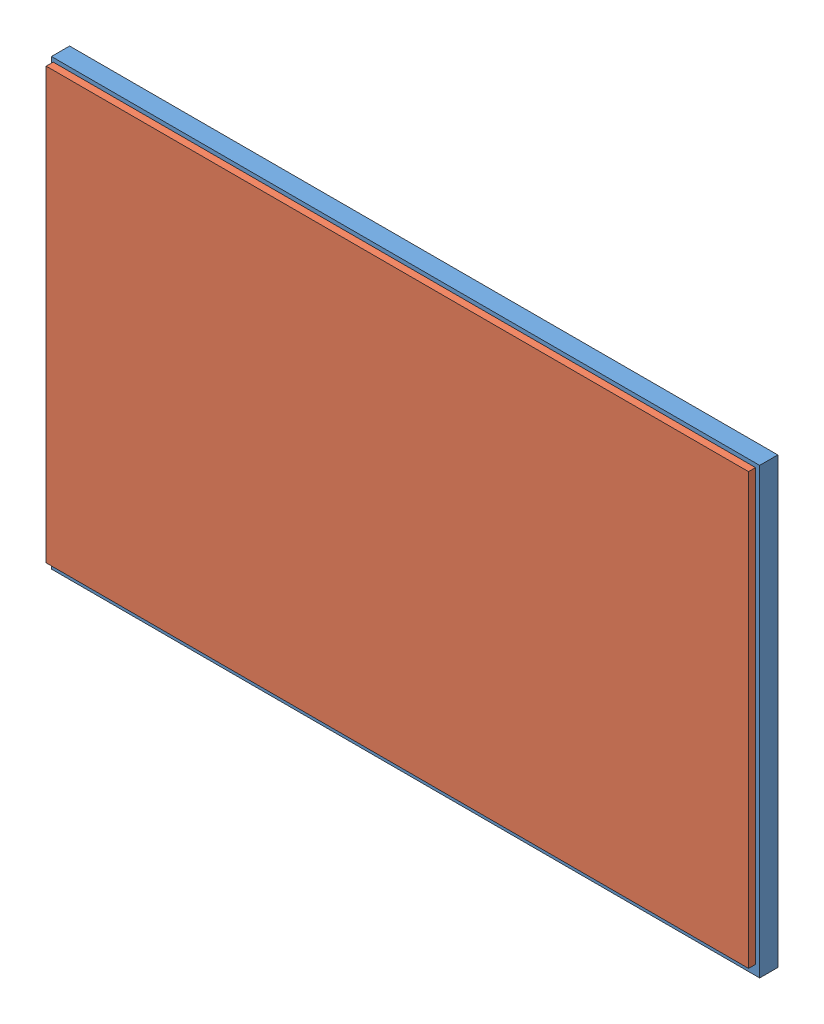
SolidWorks assembly TFT_module.SLDASM, configuration Default (file format 6000). Lengths in mm.
Overall size (121 75.85 4.4).
2 component instances, 2 part files, 2 mates.
Components (placement in the parent):
- TFT_minus_touch_panel-1: TFT_minus_touch_panel.SLDPRT [Default] at (43.3538 65.2423 92.1451) size (121 75.85 3.1)
- TFT_touch_panel-1: TFT_touch_panel.SLDPRT [Default] at (43.2538 65.8373 95.3451) size (120 73.5 1.2)
Mates (geometry in assembly coordinates):
- Distance1: distance = 0.58 mm aligned: plane of TFT_minus_touch_panel-1 through (-17.1462 103.1673 95.2451) normal (0 1 0); plane of TFT_touch_panel-1 through (-16.7462 102.5873 96.5451) normal (0 1 0)
- Distance2: distance = 0.4 mm aligned: plane of TFT_minus_touch_panel-1 through (-17.1462 103.1673 95.2451) normal (-1 0 0); plane of TFT_touch_panel-1 through (-16.7462 102.5873 96.5451) normal (-1 0 0)
